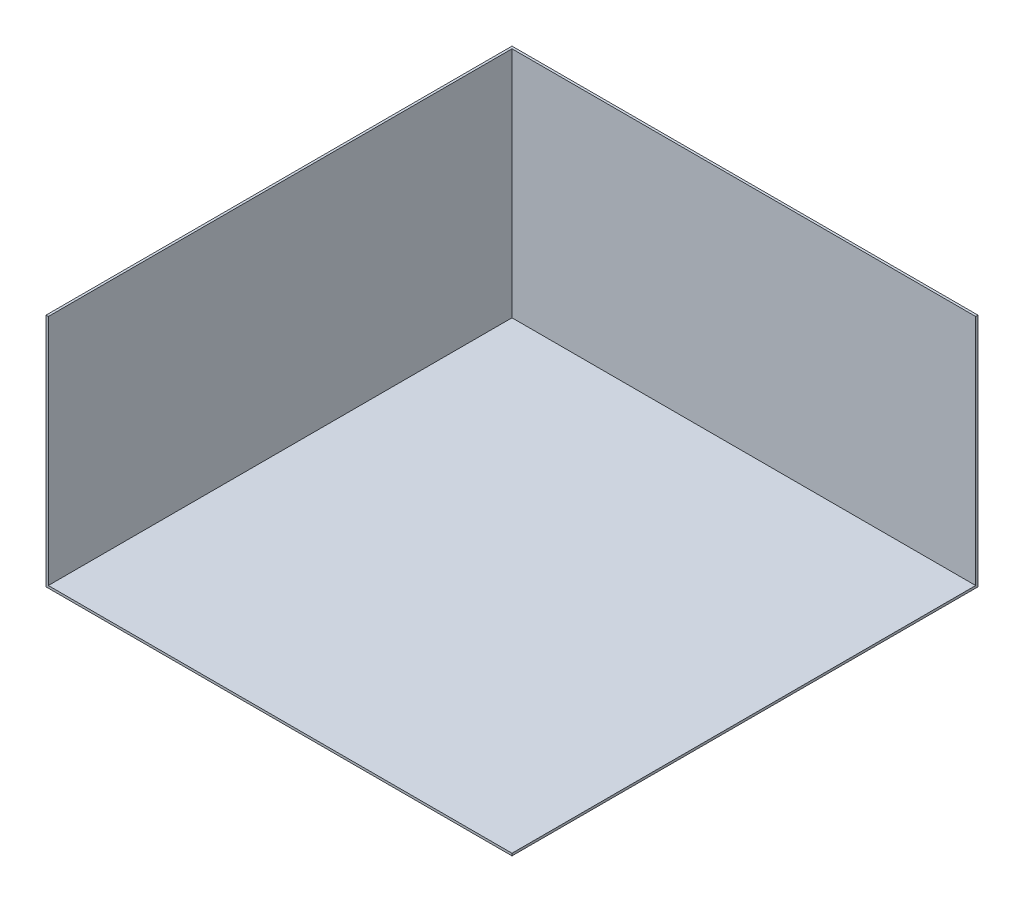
ISO-10303-21;
HEADER;
FILE_DESCRIPTION(('STEP AP214'),'2;1');
FILE_NAME('part.step','',(''),(''),'','','');
FILE_SCHEMA(('AUTOMOTIVE_DESIGN { 1 0 10303 214 1 1 1 1 }'));
ENDSEC;
DATA;
#1=APPLICATION_CONTEXT('core data for automotive mechanical design processes');
#2=APPLICATION_PROTOCOL_DEFINITION('international standard','automotive_design',2000,#1);
#3=PRODUCT_CONTEXT('',#1,'mechanical');
#4=PRODUCT('Part','Part','',(#3));
#5=PRODUCT_RELATED_PRODUCT_CATEGORY('part','',(#4));
#6=PRODUCT_DEFINITION_FORMATION('','',#4);
#7=PRODUCT_DEFINITION_CONTEXT('part definition',#1,'design');
#8=PRODUCT_DEFINITION('design','',#6,#7);
#9=PRODUCT_DEFINITION_SHAPE('','',#8);
#10=(LENGTH_UNIT() NAMED_UNIT(*) SI_UNIT(.MILLI.,.METRE.));
#11=(NAMED_UNIT(*) PLANE_ANGLE_UNIT() SI_UNIT($,.RADIAN.));
#12=(NAMED_UNIT(*) SI_UNIT($,.STERADIAN.) SOLID_ANGLE_UNIT());
#13=UNCERTAINTY_MEASURE_WITH_UNIT(LENGTH_MEASURE(1.E-05),#10,'distance_accuracy_value','');
#14=(GEOMETRIC_REPRESENTATION_CONTEXT(3) GLOBAL_UNCERTAINTY_ASSIGNED_CONTEXT((#13)) GLOBAL_UNIT_ASSIGNED_CONTEXT((#10,
#11,#12)) REPRESENTATION_CONTEXT('',''));
#15=CARTESIAN_POINT('',(0.,0.,0.));
#16=DIRECTION('',(0.,0.,1.));
#17=DIRECTION('',(1.,0.,0.));
#18=AXIS2_PLACEMENT_3D('',#15,#16,#17);
#19=CARTESIAN_POINT('',(0.,25.4,0.));
#20=DIRECTION('',(-1.,0.,0.));
#21=DIRECTION('',(0.,0.,1.));
#22=AXIS2_PLACEMENT_3D('',#19,#20,#21);
#23=PLANE('',#22);
#24=DIRECTION('',(0.,0.,-1.));
#25=VECTOR('',#24,1.);
#26=CARTESIAN_POINT('',(0.,0.,0.));
#27=LINE('',#26,#25);
#28=CARTESIAN_POINT('',(6.22120573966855E-13,0.,5080.));
#29=VERTEX_POINT('',#28);
#30=CARTESIAN_POINT('',(0.,0.,0.));
#31=VERTEX_POINT('',#30);
#32=EDGE_CURVE('E180',#29,#31,#27,.T.);
#33=ORIENTED_EDGE('',*,*,#32,.T.);
#34=DIRECTION('',(0.,-1.,0.));
#35=VECTOR('',#34,1.);
#36=CARTESIAN_POINT('',(0.,25.4,0.));
#37=LINE('',#36,#35);
#38=CARTESIAN_POINT('',(0.,2565.4,0.));
#39=VERTEX_POINT('',#38);
#40=EDGE_CURVE('E12',#39,#31,#37,.T.);
#41=ORIENTED_EDGE('',*,*,#40,.F.);
#42=DIRECTION('',(0.,0.,1.));
#43=VECTOR('',#42,1.);
#44=CARTESIAN_POINT('',(0.,2565.4,0.));
#45=LINE('',#44,#43);
#46=CARTESIAN_POINT('',(0.,2565.4,25.3999999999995));
#47=VERTEX_POINT('',#46);
#48=EDGE_CURVE('E193',#39,#47,#45,.T.);
#49=ORIENTED_EDGE('',*,*,#48,.T.);
#50=DIRECTION('',(0.,-1.,0.));
#51=VECTOR('',#50,1.);
#52=CARTESIAN_POINT('',(0.,2565.4,25.3999999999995));
#53=LINE('',#52,#51);
#54=CARTESIAN_POINT('',(0.,25.4,25.4000000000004));
#55=VERTEX_POINT('',#54);
#56=EDGE_CURVE('E194',#47,#55,#53,.T.);
#57=ORIENTED_EDGE('',*,*,#56,.T.);
#58=DIRECTION('',(0.,0.,-1.));
#59=VECTOR('',#58,1.);
#60=CARTESIAN_POINT('',(0.,25.4,0.));
#61=LINE('',#60,#59);
#62=CARTESIAN_POINT('',(6.22120573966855E-13,25.4,5080.));
#63=VERTEX_POINT('',#62);
#64=EDGE_CURVE('E81',#63,#55,#61,.T.);
#65=ORIENTED_EDGE('',*,*,#64,.F.);
#66=DIRECTION('',(0.,-1.,0.));
#67=VECTOR('',#66,1.);
#68=CARTESIAN_POINT('',(6.22120573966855E-13,25.4,5080.));
#69=LINE('',#68,#67);
#70=EDGE_CURVE('E163',#63,#29,#69,.T.);
#71=ORIENTED_EDGE('',*,*,#70,.T.);
#72=EDGE_LOOP('',(#33,#41,#49,#57,#65,#71));
#73=FACE_BOUND('',#72,.T.);
#74=ADVANCED_FACE('F60',(#73),#23,.F.);
#75=CARTESIAN_POINT('',(0.,25.4,0.));
#76=DIRECTION('',(0.,0.,1.));
#77=DIRECTION('',(1.,0.,0.));
#78=AXIS2_PLACEMENT_3D('',#75,#76,#77);
#79=PLANE('',#78);
#80=DIRECTION('',(-1.,0.,0.));
#81=VECTOR('',#80,1.);
#82=CARTESIAN_POINT('',(0.,0.,0.));
#83=LINE('',#82,#81);
#84=CARTESIAN_POINT('',(-5080.,0.,6.22120573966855E-13));
#85=VERTEX_POINT('',#84);
#86=EDGE_CURVE('E183',#31,#85,#83,.T.);
#87=ORIENTED_EDGE('',*,*,#86,.T.);
#88=DIRECTION('',(0.,-1.,0.));
#89=VECTOR('',#88,1.);
#90=CARTESIAN_POINT('',(-5080.,25.4,6.22120573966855E-13));
#91=LINE('',#90,#89);
#92=CARTESIAN_POINT('',(-5080.,2565.4,0.));
#93=VERTEX_POINT('',#92);
#94=EDGE_CURVE('E68',#93,#85,#91,.T.);
#95=ORIENTED_EDGE('',*,*,#94,.F.);
#96=DIRECTION('',(1.,0.,0.));
#97=VECTOR('',#96,1.);
#98=CARTESIAN_POINT('',(-5080.,2565.4,0.));
#99=LINE('',#98,#97);
#100=EDGE_CURVE('E143',#93,#39,#99,.T.);
#101=ORIENTED_EDGE('',*,*,#100,.T.);
#102=ORIENTED_EDGE('',*,*,#40,.T.);
#103=EDGE_LOOP('',(#87,#95,#101,#102));
#104=FACE_BOUND('',#103,.T.);
#105=ADVANCED_FACE('F190',(#104),#79,.F.);
#106=CARTESIAN_POINT('',(-5080.,25.4,6.22120573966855E-13));
#107=DIRECTION('',(1.,0.,0.));
#108=DIRECTION('',(0.,0.,-1.));
#109=AXIS2_PLACEMENT_3D('',#106,#107,#108);
#110=PLANE('',#109);
#111=DIRECTION('',(0.,0.,1.));
#112=VECTOR('',#111,1.);
#113=CARTESIAN_POINT('',(-5080.,0.,6.22120573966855E-13));
#114=LINE('',#113,#112);
#115=CARTESIAN_POINT('',(-5080.,0.,5080.));
#116=VERTEX_POINT('',#115);
#117=EDGE_CURVE('E161',#85,#116,#114,.T.);
#118=ORIENTED_EDGE('',*,*,#117,.T.);
#119=DIRECTION('',(0.,-1.,0.));
#120=VECTOR('',#119,1.);
#121=CARTESIAN_POINT('',(-5080.,25.4,5080.));
#122=LINE('',#121,#120);
#123=CARTESIAN_POINT('',(-5080.,2565.4,5080.));
#124=VERTEX_POINT('',#123);
#125=EDGE_CURVE('E160',#124,#116,#122,.T.);
#126=ORIENTED_EDGE('',*,*,#125,.F.);
#127=DIRECTION('',(0.,0.,-1.));
#128=VECTOR('',#127,1.);
#129=CARTESIAN_POINT('',(-5080.,2565.4,5080.));
#130=LINE('',#129,#128);
#131=EDGE_CURVE('E128',#124,#93,#130,.T.);
#132=ORIENTED_EDGE('',*,*,#131,.T.);
#133=ORIENTED_EDGE('',*,*,#94,.T.);
#134=EDGE_LOOP('',(#118,#126,#132,#133));
#135=FACE_BOUND('',#134,.T.);
#136=ADVANCED_FACE('F158',(#135),#110,.F.);
#137=CARTESIAN_POINT('',(6.22120573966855E-13,25.4,5080.));
#138=DIRECTION('',(0.,0.,-1.));
#139=DIRECTION('',(-1.,0.,0.));
#140=AXIS2_PLACEMENT_3D('',#137,#138,#139);
#141=PLANE('',#140);
#142=DIRECTION('',(1.,0.,0.));
#143=VECTOR('',#142,1.);
#144=CARTESIAN_POINT('',(6.22120573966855E-13,0.,5080.));
#145=LINE('',#144,#143);
#146=EDGE_CURVE('E172',#116,#29,#145,.T.);
#147=ORIENTED_EDGE('',*,*,#146,.T.);
#148=ORIENTED_EDGE('',*,*,#70,.F.);
#149=DIRECTION('',(1.,0.,0.));
#150=VECTOR('',#149,1.);
#151=CARTESIAN_POINT('',(6.22120573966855E-13,25.4,5080.));
#152=LINE('',#151,#150);
#153=CARTESIAN_POINT('',(-5054.59999999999,25.4,5080.));
#154=VERTEX_POINT('',#153);
#155=EDGE_CURVE('E136',#154,#63,#152,.T.);
#156=ORIENTED_EDGE('',*,*,#155,.F.);
#157=DIRECTION('',(0.,-1.,0.));
#158=VECTOR('',#157,1.);
#159=CARTESIAN_POINT('',(-5054.6,2565.4,5080.));
#160=LINE('',#159,#158);
#161=CARTESIAN_POINT('',(-5054.6,2565.4,5080.));
#162=VERTEX_POINT('',#161);
#163=EDGE_CURVE('E133',#162,#154,#160,.T.);
#164=ORIENTED_EDGE('',*,*,#163,.F.);
#165=DIRECTION('',(1.,0.,0.));
#166=VECTOR('',#165,1.);
#167=CARTESIAN_POINT('',(-5080.,2565.4,5080.));
#168=LINE('',#167,#166);
#169=EDGE_CURVE('E120',#124,#162,#168,.T.);
#170=ORIENTED_EDGE('',*,*,#169,.F.);
#171=ORIENTED_EDGE('',*,*,#125,.T.);
#172=EDGE_LOOP('',(#147,#148,#156,#164,#170,#171));
#173=FACE_BOUND('',#172,.T.);
#174=ADVANCED_FACE('F134',(#173),#141,.F.);
#175=CARTESIAN_POINT('',(6.22120573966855E-13,25.4,5080.));
#176=DIRECTION('',(0.,-1.,0.));
#177=DIRECTION('',(0.,0.,-1.));
#178=AXIS2_PLACEMENT_3D('',#175,#176,#177);
#179=PLANE('',#178);
#180=ORIENTED_EDGE('',*,*,#64,.T.);
#181=DIRECTION('',(-1.,0.,0.));
#182=VECTOR('',#181,1.);
#183=CARTESIAN_POINT('',(0.,25.4,25.3999999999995));
#184=LINE('',#183,#182);
#185=CARTESIAN_POINT('',(-5054.6,25.4,25.4000000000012));
#186=VERTEX_POINT('',#185);
#187=EDGE_CURVE('E197',#55,#186,#184,.T.);
#188=ORIENTED_EDGE('',*,*,#187,.T.);
#189=DIRECTION('',(0.,0.,-1.));
#190=VECTOR('',#189,1.);
#191=CARTESIAN_POINT('',(-5054.6,25.4,5080.));
#192=LINE('',#191,#190);
#193=EDGE_CURVE('E76',#154,#186,#192,.T.);
#194=ORIENTED_EDGE('',*,*,#193,.F.);
#195=ORIENTED_EDGE('',*,*,#155,.T.);
#196=EDGE_LOOP('',(#180,#188,#194,#195));
#197=FACE_BOUND('',#196,.T.);
#198=ADVANCED_FACE('F202',(#197),#179,.F.);
#199=CARTESIAN_POINT('',(6.22120573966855E-13,0.,5080.));
#200=DIRECTION('',(0.,-1.,0.));
#201=DIRECTION('',(0.,0.,-1.));
#202=AXIS2_PLACEMENT_3D('',#199,#200,#201);
#203=PLANE('',#202);
#204=ORIENTED_EDGE('',*,*,#32,.F.);
#205=ORIENTED_EDGE('',*,*,#146,.F.);
#206=ORIENTED_EDGE('',*,*,#117,.F.);
#207=ORIENTED_EDGE('',*,*,#86,.F.);
#208=EDGE_LOOP('',(#204,#205,#206,#207));
#209=FACE_BOUND('',#208,.T.);
#210=ADVANCED_FACE('F188',(#209),#203,.T.);
#211=CARTESIAN_POINT('',(-5054.6,2565.4,5080.));
#212=DIRECTION('',(-1.,0.,0.));
#213=DIRECTION('',(0.,0.,1.));
#214=AXIS2_PLACEMENT_3D('',#211,#212,#213);
#215=PLANE('',#214);
#216=DIRECTION('',(0.,-1.,0.));
#217=VECTOR('',#216,1.);
#218=CARTESIAN_POINT('',(-5054.6,2565.4,25.4000000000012));
#219=LINE('',#218,#217);
#220=CARTESIAN_POINT('',(-5054.6,2565.4,25.4000000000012));
#221=VERTEX_POINT('',#220);
#222=EDGE_CURVE('E138',#221,#186,#219,.T.);
#223=ORIENTED_EDGE('',*,*,#222,.F.);
#224=DIRECTION('',(0.,0.,-1.));
#225=VECTOR('',#224,1.);
#226=CARTESIAN_POINT('',(-5054.6,2565.4,5080.));
#227=LINE('',#226,#225);
#228=EDGE_CURVE('E126',#162,#221,#227,.T.);
#229=ORIENTED_EDGE('',*,*,#228,.F.);
#230=ORIENTED_EDGE('',*,*,#163,.T.);
#231=ORIENTED_EDGE('',*,*,#193,.T.);
#232=EDGE_LOOP('',(#223,#229,#230,#231));
#233=FACE_BOUND('',#232,.T.);
#234=ADVANCED_FACE('F140',(#233),#215,.F.);
#235=CARTESIAN_POINT('',(-5054.6,2565.4,0.));
#236=DIRECTION('',(0.,1.,0.));
#237=DIRECTION('',(0.,0.,1.));
#238=AXIS2_PLACEMENT_3D('',#235,#236,#237);
#239=PLANE('',#238);
#240=ORIENTED_EDGE('',*,*,#100,.F.);
#241=ORIENTED_EDGE('',*,*,#131,.F.);
#242=ORIENTED_EDGE('',*,*,#169,.T.);
#243=ORIENTED_EDGE('',*,*,#228,.T.);
#244=DIRECTION('',(-1.,0.,0.));
#245=VECTOR('',#244,1.);
#246=CARTESIAN_POINT('',(0.,2565.4,25.3999999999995));
#247=LINE('',#246,#245);
#248=EDGE_CURVE('E196',#47,#221,#247,.T.);
#249=ORIENTED_EDGE('',*,*,#248,.F.);
#250=ORIENTED_EDGE('',*,*,#48,.F.);
#251=EDGE_LOOP('',(#240,#241,#242,#243,#249,#250));
#252=FACE_BOUND('',#251,.T.);
#253=ADVANCED_FACE('F123',(#252),#239,.T.);
#254=CARTESIAN_POINT('',(0.,2565.4,25.3999999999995));
#255=DIRECTION('',(0.,0.,1.));
#256=DIRECTION('',(1.,0.,0.));
#257=AXIS2_PLACEMENT_3D('',#254,#255,#256);
#258=PLANE('',#257);
#259=ORIENTED_EDGE('',*,*,#187,.F.);
#260=ORIENTED_EDGE('',*,*,#56,.F.);
#261=ORIENTED_EDGE('',*,*,#248,.T.);
#262=ORIENTED_EDGE('',*,*,#222,.T.);
#263=EDGE_LOOP('',(#259,#260,#261,#262));
#264=FACE_BOUND('',#263,.T.);
#265=ADVANCED_FACE('F204',(#264),#258,.T.);
#266=CLOSED_SHELL('',(#74,#105,#136,#174,#198,#210,#234,#253,#265));
#267=MANIFOLD_SOLID_BREP('B2',#266);
#268=ADVANCED_BREP_SHAPE_REPRESENTATION('',(#18,#267),#14);
#269=SHAPE_DEFINITION_REPRESENTATION(#9,#268);
ENDSEC;
END-ISO-10303-21;
